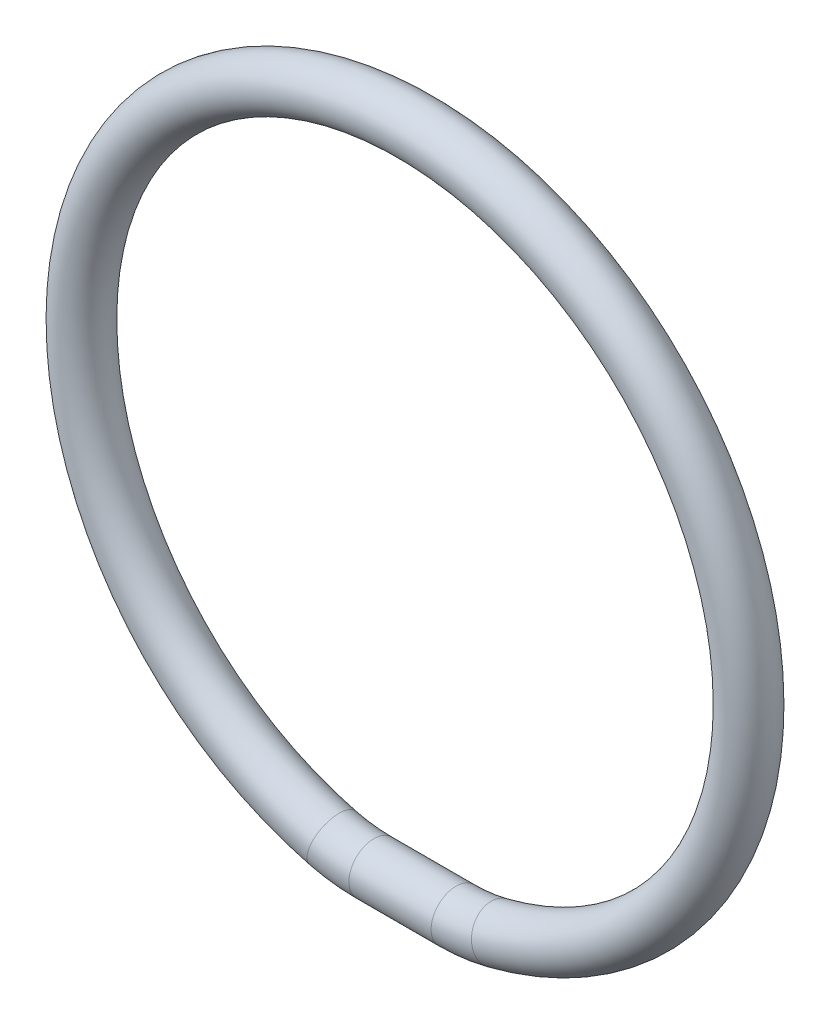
ISO-10303-21;
HEADER;
FILE_DESCRIPTION(('STEP AP214'),'2;1');
FILE_NAME('part.step','',(''),(''),'','','');
FILE_SCHEMA(('AUTOMOTIVE_DESIGN { 1 0 10303 214 1 1 1 1 }'));
ENDSEC;
DATA;
#1=APPLICATION_CONTEXT('core data for automotive mechanical design processes');
#2=APPLICATION_PROTOCOL_DEFINITION('international standard','automotive_design',2000,#1);
#3=PRODUCT_CONTEXT('',#1,'mechanical');
#4=PRODUCT('Part','Part','',(#3));
#5=PRODUCT_RELATED_PRODUCT_CATEGORY('part','',(#4));
#6=PRODUCT_DEFINITION_FORMATION('','',#4);
#7=PRODUCT_DEFINITION_CONTEXT('part definition',#1,'design');
#8=PRODUCT_DEFINITION('design','',#6,#7);
#9=PRODUCT_DEFINITION_SHAPE('','',#8);
#10=(LENGTH_UNIT() NAMED_UNIT(*) SI_UNIT(.MILLI.,.METRE.));
#11=(NAMED_UNIT(*) PLANE_ANGLE_UNIT() SI_UNIT($,.RADIAN.));
#12=(NAMED_UNIT(*) SI_UNIT($,.STERADIAN.) SOLID_ANGLE_UNIT());
#13=UNCERTAINTY_MEASURE_WITH_UNIT(LENGTH_MEASURE(1.E-05),#10,'distance_accuracy_value','');
#14=(GEOMETRIC_REPRESENTATION_CONTEXT(3) GLOBAL_UNCERTAINTY_ASSIGNED_CONTEXT((#13)) GLOBAL_UNIT_ASSIGNED_CONTEXT((#10,
#11,#12)) REPRESENTATION_CONTEXT('',''));
#15=CARTESIAN_POINT('',(0.,0.,0.));
#16=DIRECTION('',(0.,0.,1.));
#17=DIRECTION('',(1.,0.,0.));
#18=AXIS2_PLACEMENT_3D('',#15,#16,#17);
#19=CARTESIAN_POINT('',(2.4652329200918,10.,0.));
#20=DIRECTION('',(0.,0.,-1.));
#21=DIRECTION('',(-1.,0.,0.));
#22=AXIS2_PLACEMENT_3D('',#19,#20,#21);
#23=TOROIDAL_SURFACE('',#22,9.99999999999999,1.5);
#24=CARTESIAN_POINT('',(4.93046584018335,0.308631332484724,0.));
#25=DIRECTION('',(0.969136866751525,0.246523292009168,0.));
#26=DIRECTION('',(0.,0.,-1.));
#27=AXIS2_PLACEMENT_3D('',#24,#25,#26);
#28=CIRCLE('',#27,1.5);
#29=CARTESIAN_POINT('',(5.30025077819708,-1.14507396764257,0.));
#30=VERTEX_POINT('',#29);
#31=EDGE_CURVE('E32',#30,#30,#28,.T.);
#32=CARTESIAN_POINT('',(2.46523292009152,0.,0.));
#33=DIRECTION('',(1.,0.,0.));
#34=DIRECTION('',(0.,0.,-1.));
#35=AXIS2_PLACEMENT_3D('',#32,#33,#34);
#36=CIRCLE('',#35,1.5);
#37=CARTESIAN_POINT('',(2.46523292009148,-1.49999999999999,0.));
#38=VERTEX_POINT('',#37);
#39=EDGE_CURVE('E10',#38,#38,#36,.T.);
#40=CARTESIAN_POINT('',(2.4652329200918,10.,0.));
#41=DIRECTION('',(0.,0.,-1.));
#42=DIRECTION('',(-1.,0.,0.));
#43=AXIS2_PLACEMENT_3D('',#40,#41,#42);
#44=CIRCLE('',#43,11.5);
#45=EDGE_CURVE('',#30,#38,#44,.T.);
#46=ORIENTED_EDGE('',*,*,#31,.F.);
#47=ORIENTED_EDGE('',*,*,#39,.T.);
#48=ORIENTED_EDGE('',*,*,#45,.T.);
#49=ORIENTED_EDGE('',*,*,#45,.F.);
#50=EDGE_LOOP('',(#46,#48,#47,#49));
#51=FACE_BOUND('',#50,.T.);
#52=ADVANCED_FACE('F26',(#51),#23,.T.);
#53=CARTESIAN_POINT('',(0.,19.6913686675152,0.));
#54=DIRECTION('',(0.,0.,-1.));
#55=DIRECTION('',(-1.,0.,0.));
#56=AXIS2_PLACEMENT_3D('',#53,#54,#55);
#57=TOROIDAL_SURFACE('',#56,20.,1.5);
#58=CARTESIAN_POINT('',(-4.9304658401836,0.308631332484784,0.));
#59=DIRECTION('',(0.969136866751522,-0.24652329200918,0.));
#60=DIRECTION('',(0.,0.,-1.));
#61=AXIS2_PLACEMENT_3D('',#58,#59,#60);
#62=CIRCLE('',#61,1.5);
#63=CARTESIAN_POINT('',(-5.30025077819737,-1.1450739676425,0.));
#64=VERTEX_POINT('',#63);
#65=EDGE_CURVE('E36',#64,#64,#62,.T.);
#66=CARTESIAN_POINT('',(0.,19.6913686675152,0.));
#67=DIRECTION('',(0.,0.,-1.));
#68=DIRECTION('',(-1.,0.,0.));
#69=AXIS2_PLACEMENT_3D('',#66,#67,#68);
#70=CIRCLE('',#69,21.5);
#71=EDGE_CURVE('',#64,#30,#70,.T.);
#72=ORIENTED_EDGE('',*,*,#65,.F.);
#73=ORIENTED_EDGE('',*,*,#31,.T.);
#74=ORIENTED_EDGE('',*,*,#71,.T.);
#75=ORIENTED_EDGE('',*,*,#71,.F.);
#76=EDGE_LOOP('',(#72,#74,#73,#75));
#77=FACE_BOUND('',#76,.T.);
#78=ADVANCED_FACE('F52',(#77),#57,.T.);
#79=CARTESIAN_POINT('',(-2.4652329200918,10.,0.));
#80=DIRECTION('',(0.,0.,-1.));
#81=DIRECTION('',(-1.,0.,0.));
#82=AXIS2_PLACEMENT_3D('',#79,#80,#81);
#83=TOROIDAL_SURFACE('',#82,10.,1.5);
#84=CARTESIAN_POINT('',(-2.46523292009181,0.,0.));
#85=DIRECTION('',(1.,0.,0.));
#86=DIRECTION('',(0.,0.,-1.));
#87=AXIS2_PLACEMENT_3D('',#84,#85,#86);
#88=CIRCLE('',#87,1.5);
#89=CARTESIAN_POINT('',(-2.46523292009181,-1.5,0.));
#90=VERTEX_POINT('',#89);
#91=EDGE_CURVE('E40',#90,#90,#88,.T.);
#92=CARTESIAN_POINT('',(-2.4652329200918,10.,0.));
#93=DIRECTION('',(0.,0.,-1.));
#94=DIRECTION('',(-1.,0.,0.));
#95=AXIS2_PLACEMENT_3D('',#92,#93,#94);
#96=CIRCLE('',#95,11.5);
#97=EDGE_CURVE('',#90,#64,#96,.T.);
#98=ORIENTED_EDGE('',*,*,#91,.F.);
#99=ORIENTED_EDGE('',*,*,#65,.T.);
#100=ORIENTED_EDGE('',*,*,#97,.T.);
#101=ORIENTED_EDGE('',*,*,#97,.F.);
#102=EDGE_LOOP('',(#98,#100,#99,#101));
#103=FACE_BOUND('',#102,.T.);
#104=ADVANCED_FACE('F49',(#103),#83,.T.);
#105=CARTESIAN_POINT('',(-2.46523292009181,0.,0.));
#106=DIRECTION('',(1.,0.,0.));
#107=DIRECTION('',(0.,0.,-1.));
#108=AXIS2_PLACEMENT_3D('',#105,#106,#107);
#109=CYLINDRICAL_SURFACE('',#108,1.5);
#110=ORIENTED_EDGE('',*,*,#91,.T.);
#111=EDGE_LOOP('',(#110));
#112=FACE_BOUND('',#111,.T.);
#113=ORIENTED_EDGE('',*,*,#39,.F.);
#114=EDGE_LOOP('',(#113));
#115=FACE_BOUND('',#114,.T.);
#116=ADVANCED_FACE('F46',(#112,#115),#109,.T.);
#117=CLOSED_SHELL('',(#52,#78,#104,#116));
#118=MANIFOLD_SOLID_BREP('B2',#117);
#119=ADVANCED_BREP_SHAPE_REPRESENTATION('',(#18,#118),#14);
#120=SHAPE_DEFINITION_REPRESENTATION(#9,#119);
ENDSEC;
END-ISO-10303-21;
